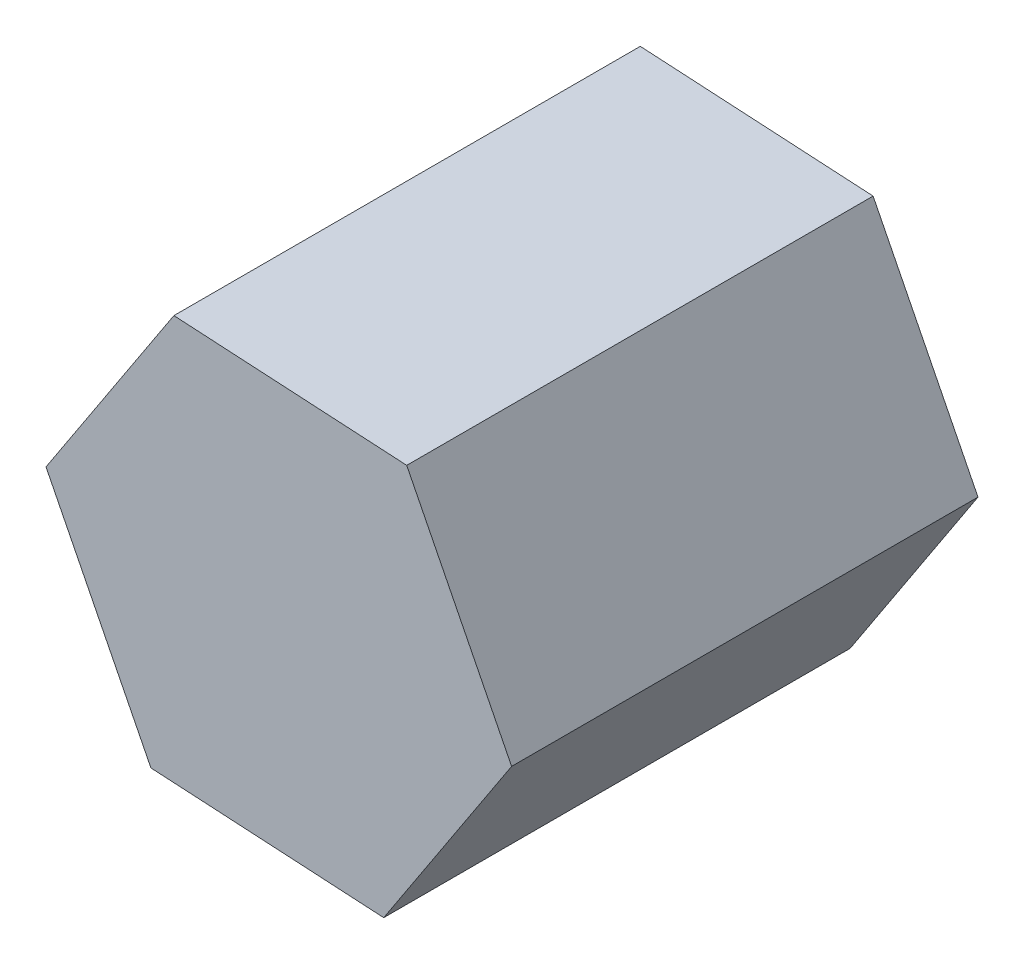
from build123d import *

# Parameters (mm, degrees)
EXTRUDE_1_DEPTH = 60


with BuildPart() as part:
    # Sketch 1 → Extrude 1 (new body)
    with BuildSketch(Plane.XY):
        Polygon((29.951276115, -1.709110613), (16.455771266, 25.084010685), (-13.495504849, 26.793121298), (-29.951276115, 1.709110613), (-16.455771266, -25.084010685), (13.495504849, -26.793121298), align=None)
    extrude(amount=EXTRUDE_1_DEPTH)


solid = part.part
